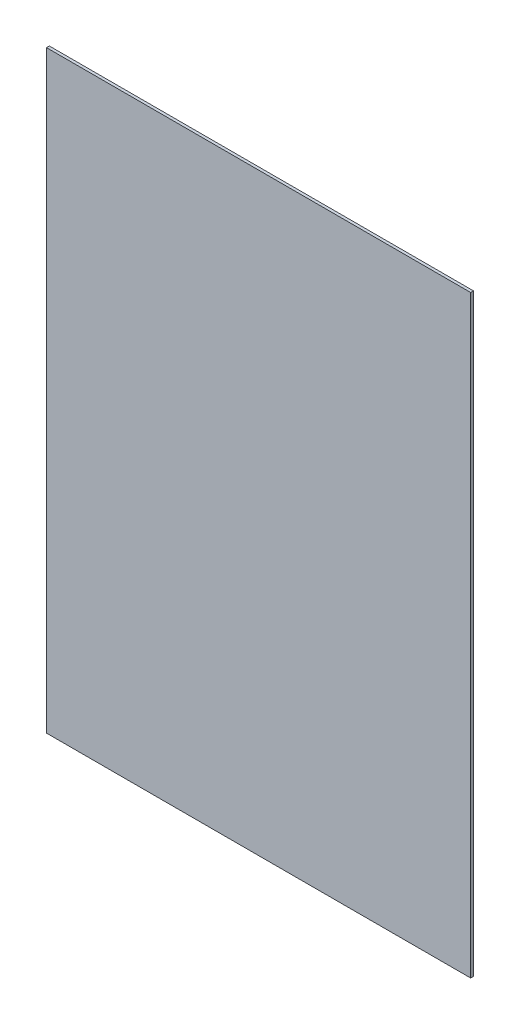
ISO-10303-21;
HEADER;
FILE_DESCRIPTION(('STEP AP214'),'2;1');
FILE_NAME('part.step','',(''),(''),'','','');
FILE_SCHEMA(('AUTOMOTIVE_DESIGN { 1 0 10303 214 1 1 1 1 }'));
ENDSEC;
DATA;
#1=APPLICATION_CONTEXT('core data for automotive mechanical design processes');
#2=APPLICATION_PROTOCOL_DEFINITION('international standard','automotive_design',2000,#1);
#3=PRODUCT_CONTEXT('',#1,'mechanical');
#4=PRODUCT('Part','Part','',(#3));
#5=PRODUCT_RELATED_PRODUCT_CATEGORY('part','',(#4));
#6=PRODUCT_DEFINITION_FORMATION('','',#4);
#7=PRODUCT_DEFINITION_CONTEXT('part definition',#1,'design');
#8=PRODUCT_DEFINITION('design','',#6,#7);
#9=PRODUCT_DEFINITION_SHAPE('','',#8);
#10=(LENGTH_UNIT() NAMED_UNIT(*) SI_UNIT(.MILLI.,.METRE.));
#11=(NAMED_UNIT(*) PLANE_ANGLE_UNIT() SI_UNIT($,.RADIAN.));
#12=(NAMED_UNIT(*) SI_UNIT($,.STERADIAN.) SOLID_ANGLE_UNIT());
#13=UNCERTAINTY_MEASURE_WITH_UNIT(LENGTH_MEASURE(1.E-05),#10,'distance_accuracy_value','');
#14=(GEOMETRIC_REPRESENTATION_CONTEXT(3) GLOBAL_UNCERTAINTY_ASSIGNED_CONTEXT((#13)) GLOBAL_UNIT_ASSIGNED_CONTEXT((#10,
#11,#12)) REPRESENTATION_CONTEXT('',''));
#15=CARTESIAN_POINT('',(0.,0.,0.));
#16=DIRECTION('',(0.,0.,1.));
#17=DIRECTION('',(1.,0.,0.));
#18=AXIS2_PLACEMENT_3D('',#15,#16,#17);
#19=CARTESIAN_POINT('',(0.,0.,2.));
#20=DIRECTION('',(1.,0.,0.));
#21=DIRECTION('',(0.,0.,-1.));
#22=AXIS2_PLACEMENT_3D('',#19,#20,#21);
#23=PLANE('',#22);
#24=DIRECTION('',(0.,-1.,0.));
#25=VECTOR('',#24,1.);
#26=CARTESIAN_POINT('',(0.,0.,0.));
#27=LINE('',#26,#25);
#28=CARTESIAN_POINT('',(0.,420.,0.));
#29=VERTEX_POINT('',#28);
#30=CARTESIAN_POINT('',(0.,0.,0.));
#31=VERTEX_POINT('',#30);
#32=EDGE_CURVE('E96',#29,#31,#27,.T.);
#33=ORIENTED_EDGE('',*,*,#32,.T.);
#34=DIRECTION('',(0.,0.,-1.));
#35=VECTOR('',#34,1.);
#36=CARTESIAN_POINT('',(0.,0.,2.));
#37=LINE('',#36,#35);
#38=CARTESIAN_POINT('',(0.,0.,2.));
#39=VERTEX_POINT('',#38);
#40=EDGE_CURVE('E11',#39,#31,#37,.T.);
#41=ORIENTED_EDGE('',*,*,#40,.F.);
#42=DIRECTION('',(0.,-1.,0.));
#43=VECTOR('',#42,1.);
#44=CARTESIAN_POINT('',(0.,0.,2.));
#45=LINE('',#44,#43);
#46=CARTESIAN_POINT('',(0.,420.,2.));
#47=VERTEX_POINT('',#46);
#48=EDGE_CURVE('E84',#47,#39,#45,.T.);
#49=ORIENTED_EDGE('',*,*,#48,.F.);
#50=DIRECTION('',(0.,0.,-1.));
#51=VECTOR('',#50,1.);
#52=CARTESIAN_POINT('',(0.,420.,2.));
#53=LINE('',#52,#51);
#54=EDGE_CURVE('E92',#47,#29,#53,.T.);
#55=ORIENTED_EDGE('',*,*,#54,.T.);
#56=EDGE_LOOP('',(#33,#41,#49,#55));
#57=FACE_BOUND('',#56,.T.);
#58=ADVANCED_FACE('F33',(#57),#23,.F.);
#59=CARTESIAN_POINT('',(0.,0.,2.));
#60=DIRECTION('',(0.,1.,0.));
#61=DIRECTION('',(0.,0.,1.));
#62=AXIS2_PLACEMENT_3D('',#59,#60,#61);
#63=PLANE('',#62);
#64=DIRECTION('',(1.,0.,0.));
#65=VECTOR('',#64,1.);
#66=CARTESIAN_POINT('',(0.,0.,0.));
#67=LINE('',#66,#65);
#68=CARTESIAN_POINT('',(300.,0.,0.));
#69=VERTEX_POINT('',#68);
#70=EDGE_CURVE('E88',#31,#69,#67,.T.);
#71=ORIENTED_EDGE('',*,*,#70,.T.);
#72=DIRECTION('',(0.,0.,-1.));
#73=VECTOR('',#72,1.);
#74=CARTESIAN_POINT('',(300.,0.,2.));
#75=LINE('',#74,#73);
#76=CARTESIAN_POINT('',(300.,0.,2.));
#77=VERTEX_POINT('',#76);
#78=EDGE_CURVE('E41',#77,#69,#75,.T.);
#79=ORIENTED_EDGE('',*,*,#78,.F.);
#80=DIRECTION('',(1.,0.,0.));
#81=VECTOR('',#80,1.);
#82=CARTESIAN_POINT('',(0.,0.,2.));
#83=LINE('',#82,#81);
#84=EDGE_CURVE('E79',#39,#77,#83,.T.);
#85=ORIENTED_EDGE('',*,*,#84,.F.);
#86=ORIENTED_EDGE('',*,*,#40,.T.);
#87=EDGE_LOOP('',(#71,#79,#85,#86));
#88=FACE_BOUND('',#87,.T.);
#89=ADVANCED_FACE('F87',(#88),#63,.F.);
#90=CARTESIAN_POINT('',(300.,0.,2.));
#91=DIRECTION('',(-1.,0.,0.));
#92=DIRECTION('',(0.,0.,1.));
#93=AXIS2_PLACEMENT_3D('',#90,#91,#92);
#94=PLANE('',#93);
#95=DIRECTION('',(0.,1.,0.));
#96=VECTOR('',#95,1.);
#97=CARTESIAN_POINT('',(300.,0.,0.));
#98=LINE('',#97,#96);
#99=CARTESIAN_POINT('',(300.,420.,0.));
#100=VERTEX_POINT('',#99);
#101=EDGE_CURVE('E66',#69,#100,#98,.T.);
#102=ORIENTED_EDGE('',*,*,#101,.T.);
#103=DIRECTION('',(0.,0.,-1.));
#104=VECTOR('',#103,1.);
#105=CARTESIAN_POINT('',(300.,420.,2.));
#106=LINE('',#105,#104);
#107=CARTESIAN_POINT('',(300.,420.,2.));
#108=VERTEX_POINT('',#107);
#109=EDGE_CURVE('E89',#108,#100,#106,.T.);
#110=ORIENTED_EDGE('',*,*,#109,.F.);
#111=DIRECTION('',(0.,1.,0.));
#112=VECTOR('',#111,1.);
#113=CARTESIAN_POINT('',(300.,0.,2.));
#114=LINE('',#113,#112);
#115=EDGE_CURVE('E82',#77,#108,#114,.T.);
#116=ORIENTED_EDGE('',*,*,#115,.F.);
#117=ORIENTED_EDGE('',*,*,#78,.T.);
#118=EDGE_LOOP('',(#102,#110,#116,#117));
#119=FACE_BOUND('',#118,.T.);
#120=ADVANCED_FACE('F90',(#119),#94,.F.);
#121=CARTESIAN_POINT('',(0.,420.,2.));
#122=DIRECTION('',(0.,-1.,0.));
#123=DIRECTION('',(0.,0.,-1.));
#124=AXIS2_PLACEMENT_3D('',#121,#122,#123);
#125=PLANE('',#124);
#126=DIRECTION('',(-1.,0.,0.));
#127=VECTOR('',#126,1.);
#128=CARTESIAN_POINT('',(0.,420.,0.));
#129=LINE('',#128,#127);
#130=EDGE_CURVE('E72',#100,#29,#129,.T.);
#131=ORIENTED_EDGE('',*,*,#130,.T.);
#132=ORIENTED_EDGE('',*,*,#54,.F.);
#133=DIRECTION('',(-1.,0.,0.));
#134=VECTOR('',#133,1.);
#135=CARTESIAN_POINT('',(0.,420.,2.));
#136=LINE('',#135,#134);
#137=EDGE_CURVE('E49',#108,#47,#136,.T.);
#138=ORIENTED_EDGE('',*,*,#137,.F.);
#139=ORIENTED_EDGE('',*,*,#109,.T.);
#140=EDGE_LOOP('',(#131,#132,#138,#139));
#141=FACE_BOUND('',#140,.T.);
#142=ADVANCED_FACE('F103',(#141),#125,.F.);
#143=CARTESIAN_POINT('',(0.,0.,2.));
#144=DIRECTION('',(0.,0.,-1.));
#145=DIRECTION('',(-1.,0.,0.));
#146=AXIS2_PLACEMENT_3D('',#143,#144,#145);
#147=PLANE('',#146);
#148=ORIENTED_EDGE('',*,*,#48,.T.);
#149=ORIENTED_EDGE('',*,*,#84,.T.);
#150=ORIENTED_EDGE('',*,*,#115,.T.);
#151=ORIENTED_EDGE('',*,*,#137,.T.);
#152=EDGE_LOOP('',(#148,#149,#150,#151));
#153=FACE_BOUND('',#152,.T.);
#154=ADVANCED_FACE('F80',(#153),#147,.F.);
#155=CARTESIAN_POINT('',(0.,0.,0.));
#156=DIRECTION('',(0.,0.,-1.));
#157=DIRECTION('',(-1.,0.,0.));
#158=AXIS2_PLACEMENT_3D('',#155,#156,#157);
#159=PLANE('',#158);
#160=ORIENTED_EDGE('',*,*,#32,.F.);
#161=ORIENTED_EDGE('',*,*,#130,.F.);
#162=ORIENTED_EDGE('',*,*,#101,.F.);
#163=ORIENTED_EDGE('',*,*,#70,.F.);
#164=EDGE_LOOP('',(#160,#161,#162,#163));
#165=FACE_BOUND('',#164,.T.);
#166=ADVANCED_FACE('F106',(#165),#159,.T.);
#167=CLOSED_SHELL('',(#58,#89,#120,#142,#154,#166));
#168=MANIFOLD_SOLID_BREP('B2',#167);
#169=ADVANCED_BREP_SHAPE_REPRESENTATION('',(#18,#168),#14);
#170=SHAPE_DEFINITION_REPRESENTATION(#9,#169);
ENDSEC;
END-ISO-10303-21;
